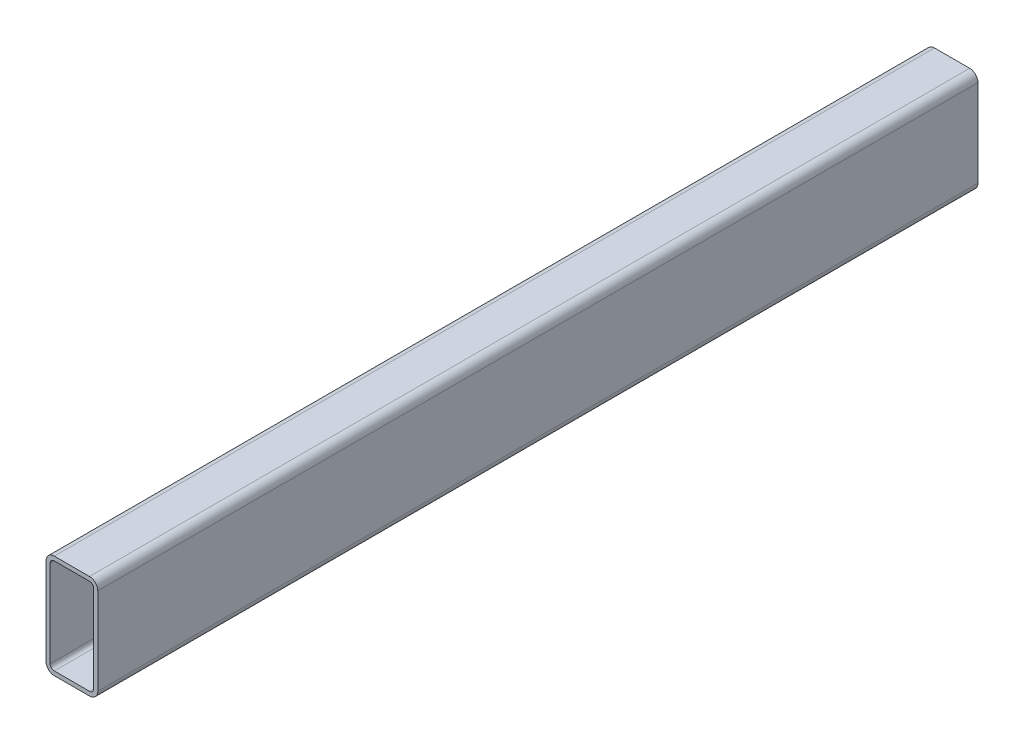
ISO-10303-21;
HEADER;
FILE_DESCRIPTION(('STEP AP214'),'2;1');
FILE_NAME('part.step','',(''),(''),'','','');
FILE_SCHEMA(('AUTOMOTIVE_DESIGN { 1 0 10303 214 1 1 1 1 }'));
ENDSEC;
DATA;
#1=APPLICATION_CONTEXT('core data for automotive mechanical design processes');
#2=APPLICATION_PROTOCOL_DEFINITION('international standard','automotive_design',2000,#1);
#3=PRODUCT_CONTEXT('',#1,'mechanical');
#4=PRODUCT('Part','Part','',(#3));
#5=PRODUCT_RELATED_PRODUCT_CATEGORY('part','',(#4));
#6=PRODUCT_DEFINITION_FORMATION('','',#4);
#7=PRODUCT_DEFINITION_CONTEXT('part definition',#1,'design');
#8=PRODUCT_DEFINITION('design','',#6,#7);
#9=PRODUCT_DEFINITION_SHAPE('','',#8);
#10=(LENGTH_UNIT() NAMED_UNIT(*) SI_UNIT(.MILLI.,.METRE.));
#11=(NAMED_UNIT(*) PLANE_ANGLE_UNIT() SI_UNIT($,.RADIAN.));
#12=(NAMED_UNIT(*) SI_UNIT($,.STERADIAN.) SOLID_ANGLE_UNIT());
#13=UNCERTAINTY_MEASURE_WITH_UNIT(LENGTH_MEASURE(1.E-05),#10,'distance_accuracy_value','');
#14=(GEOMETRIC_REPRESENTATION_CONTEXT(3) GLOBAL_UNCERTAINTY_ASSIGNED_CONTEXT((#13)) GLOBAL_UNIT_ASSIGNED_CONTEXT((#10,
#11,#12)) REPRESENTATION_CONTEXT('',''));
#15=CARTESIAN_POINT('',(0.,0.,0.));
#16=DIRECTION('',(0.,0.,1.));
#17=DIRECTION('',(1.,0.,0.));
#18=AXIS2_PLACEMENT_3D('',#15,#16,#17);
#19=CARTESIAN_POINT('',(42.0000000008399,92.0000000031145,-1186.44303583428));
#20=DIRECTION('',(1.04242850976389E-12,3.86546770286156E-12,-1.));
#21=DIRECTION('',(1.,0.,1.04242850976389E-12));
#22=AXIS2_PLACEMENT_3D('',#19,#20,#21);
#23=PLANE('',#22);
#24=CARTESIAN_POINT('',(42.0000000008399,92.0000000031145,-1186.44303583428));
#25=DIRECTION('',(-1.04242850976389E-12,-3.86546770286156E-12,1.));
#26=DIRECTION('',(1.,0.,1.04242850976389E-12));
#27=AXIS2_PLACEMENT_3D('',#24,#25,#26);
#28=CIRCLE('',#27,8.00000000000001);
#29=CARTESIAN_POINT('',(50.0000000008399,92.0000000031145,-1186.44303583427));
#30=VERTEX_POINT('',#29);
#31=CARTESIAN_POINT('',(42.0000000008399,100.000000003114,-1186.44303583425));
#32=VERTEX_POINT('',#31);
#33=EDGE_CURVE('E232',#30,#32,#28,.T.);
#34=ORIENTED_EDGE('',*,*,#33,.F.);
#35=DIRECTION('',(0.,1.,3.86546770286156E-12));
#36=VECTOR('',#35,1.);
#37=CARTESIAN_POINT('',(50.0000000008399,92.0000000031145,-1186.44303583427));
#38=LINE('',#37,#36);
#39=CARTESIAN_POINT('',(50.0000000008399,8.00000000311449,-1186.44303583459));
#40=VERTEX_POINT('',#39);
#41=EDGE_CURVE('E253',#40,#30,#38,.T.);
#42=ORIENTED_EDGE('',*,*,#41,.F.);
#43=CARTESIAN_POINT('',(42.0000000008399,8.00000000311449,-1186.4430358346));
#44=DIRECTION('',(-1.04242850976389E-12,-3.86546770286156E-12,1.));
#45=DIRECTION('',(1.,0.,1.04242850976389E-12));
#46=AXIS2_PLACEMENT_3D('',#43,#44,#45);
#47=CIRCLE('',#46,8.);
#48=CARTESIAN_POINT('',(42.0000000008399,3.11449397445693E-09,-1186.44303583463));
#49=VERTEX_POINT('',#48);
#50=EDGE_CURVE('E250',#49,#40,#47,.T.);
#51=ORIENTED_EDGE('',*,*,#50,.F.);
#52=DIRECTION('',(1.,0.,1.04242850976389E-12));
#53=VECTOR('',#52,1.);
#54=CARTESIAN_POINT('',(8.00000000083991,3.11449050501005E-09,-1186.44303583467));
#55=LINE('',#54,#53);
#56=CARTESIAN_POINT('',(8.00000000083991,3.11449050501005E-09,-1186.44303583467));
#57=VERTEX_POINT('',#56);
#58=EDGE_CURVE('E247',#57,#49,#55,.T.);
#59=ORIENTED_EDGE('',*,*,#58,.F.);
#60=CARTESIAN_POINT('',(8.00000000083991,8.00000000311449,-1186.44303583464));
#61=DIRECTION('',(-1.04242850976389E-12,-3.86546770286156E-12,1.));
#62=DIRECTION('',(1.,0.,1.04242850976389E-12));
#63=AXIS2_PLACEMENT_3D('',#60,#61,#62);
#64=CIRCLE('',#63,8.);
#65=CARTESIAN_POINT('',(8.39907081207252E-10,8.00000000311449,-1186.44303583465));
#66=VERTEX_POINT('',#65);
#67=EDGE_CURVE('E244',#66,#57,#64,.T.);
#68=ORIENTED_EDGE('',*,*,#67,.F.);
#69=DIRECTION('',(0.,-1.,-3.86546770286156E-12));
#70=VECTOR('',#69,1.);
#71=CARTESIAN_POINT('',(8.39907081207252E-10,8.00000000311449,-1186.44303583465));
#72=LINE('',#71,#70);
#73=CARTESIAN_POINT('',(8.39891261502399E-10,92.0000000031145,-1186.44303583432));
#74=VERTEX_POINT('',#73);
#75=EDGE_CURVE('E241',#74,#66,#72,.T.);
#76=ORIENTED_EDGE('',*,*,#75,.F.);
#77=CARTESIAN_POINT('',(8.00000000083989,92.0000000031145,-1186.44303583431));
#78=DIRECTION('',(-1.04242850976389E-12,-3.86546770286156E-12,1.));
#79=DIRECTION('',(1.,0.,1.04242850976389E-12));
#80=AXIS2_PLACEMENT_3D('',#77,#78,#79);
#81=CIRCLE('',#80,8.);
#82=CARTESIAN_POINT('',(8.00000000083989,100.000000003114,-1186.44303583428));
#83=VERTEX_POINT('',#82);
#84=EDGE_CURVE('E238',#83,#74,#81,.T.);
#85=ORIENTED_EDGE('',*,*,#84,.F.);
#86=DIRECTION('',(-1.,0.,-1.04242850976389E-12));
#87=VECTOR('',#86,1.);
#88=CARTESIAN_POINT('',(42.0000000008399,100.000000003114,-1186.44303583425));
#89=LINE('',#88,#87);
#90=EDGE_CURVE('E235',#32,#83,#89,.T.);
#91=ORIENTED_EDGE('',*,*,#90,.F.);
#92=EDGE_LOOP('',(#34,#42,#51,#59,#68,#76,#85,#91));
#93=FACE_BOUND('',#92,.T.);
#94=DIRECTION('',(0.,-1.,-3.86546770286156E-12));
#95=VECTOR('',#94,1.);
#96=CARTESIAN_POINT('',(4.00000000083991,8.00000000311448,-1186.44303583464));
#97=LINE('',#96,#95);
#98=CARTESIAN_POINT('',(4.00000000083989,92.0000000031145,-1186.44303583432));
#99=VERTEX_POINT('',#98);
#100=CARTESIAN_POINT('',(4.00000000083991,8.00000000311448,-1186.44303583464));
#101=VERTEX_POINT('',#100);
#102=EDGE_CURVE('E146',#99,#101,#97,.T.);
#103=ORIENTED_EDGE('',*,*,#102,.T.);
#104=CARTESIAN_POINT('',(8.00000000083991,8.00000000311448,-1186.44303583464));
#105=DIRECTION('',(-1.04242850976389E-12,-3.86546770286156E-12,1.));
#106=DIRECTION('',(1.,0.,1.04242850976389E-12));
#107=AXIS2_PLACEMENT_3D('',#104,#105,#106);
#108=CIRCLE('',#107,4.);
#109=CARTESIAN_POINT('',(8.00000000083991,4.00000000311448,-1186.44303583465));
#110=VERTEX_POINT('',#109);
#111=EDGE_CURVE('E180',#101,#110,#108,.T.);
#112=ORIENTED_EDGE('',*,*,#111,.T.);
#113=DIRECTION('',(1.,0.,1.04242850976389E-12));
#114=VECTOR('',#113,1.);
#115=CARTESIAN_POINT('',(8.00000000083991,4.00000000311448,-1186.44303583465));
#116=LINE('',#115,#114);
#117=CARTESIAN_POINT('',(42.0000000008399,4.00000000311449,-1186.44303583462));
#118=VERTEX_POINT('',#117);
#119=EDGE_CURVE('E183',#110,#118,#116,.T.);
#120=ORIENTED_EDGE('',*,*,#119,.T.);
#121=CARTESIAN_POINT('',(42.0000000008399,8.00000000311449,-1186.4430358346));
#122=DIRECTION('',(-1.04242850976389E-12,-3.86546770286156E-12,1.));
#123=DIRECTION('',(1.,0.,1.04242850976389E-12));
#124=AXIS2_PLACEMENT_3D('',#121,#122,#123);
#125=CIRCLE('',#124,4.);
#126=CARTESIAN_POINT('',(46.0000000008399,8.00000000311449,-1186.4430358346));
#127=VERTEX_POINT('',#126);
#128=EDGE_CURVE('E186',#118,#127,#125,.T.);
#129=ORIENTED_EDGE('',*,*,#128,.T.);
#130=DIRECTION('',(0.,1.,3.86546770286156E-12));
#131=VECTOR('',#130,1.);
#132=CARTESIAN_POINT('',(46.0000000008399,92.0000000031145,-1186.44303583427));
#133=LINE('',#132,#131);
#134=CARTESIAN_POINT('',(46.0000000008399,92.0000000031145,-1186.44303583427));
#135=VERTEX_POINT('',#134);
#136=EDGE_CURVE('E189',#127,#135,#133,.T.);
#137=ORIENTED_EDGE('',*,*,#136,.T.);
#138=CARTESIAN_POINT('',(42.0000000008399,92.0000000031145,-1186.44303583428));
#139=DIRECTION('',(-1.04242850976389E-12,-3.86546770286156E-12,1.));
#140=DIRECTION('',(1.,0.,1.04242850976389E-12));
#141=AXIS2_PLACEMENT_3D('',#138,#139,#140);
#142=CIRCLE('',#141,4.00000000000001);
#143=CARTESIAN_POINT('',(42.0000000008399,96.0000000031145,-1186.44303583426));
#144=VERTEX_POINT('',#143);
#145=EDGE_CURVE('E192',#135,#144,#142,.T.);
#146=ORIENTED_EDGE('',*,*,#145,.T.);
#147=DIRECTION('',(-1.,0.,-1.04242850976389E-12));
#148=VECTOR('',#147,1.);
#149=CARTESIAN_POINT('',(42.0000000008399,96.0000000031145,-1186.44303583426));
#150=LINE('',#149,#148);
#151=CARTESIAN_POINT('',(8.00000000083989,96.0000000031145,-1186.4430358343));
#152=VERTEX_POINT('',#151);
#153=EDGE_CURVE('E195',#144,#152,#150,.T.);
#154=ORIENTED_EDGE('',*,*,#153,.T.);
#155=CARTESIAN_POINT('',(8.00000000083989,92.0000000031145,-1186.44303583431));
#156=DIRECTION('',(-1.04242850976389E-12,-3.86546770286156E-12,1.));
#157=DIRECTION('',(1.,0.,1.04242850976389E-12));
#158=AXIS2_PLACEMENT_3D('',#155,#156,#157);
#159=CIRCLE('',#158,4.);
#160=EDGE_CURVE('E177',#152,#99,#159,.T.);
#161=ORIENTED_EDGE('',*,*,#160,.T.);
#162=EDGE_LOOP('',(#103,#112,#120,#129,#137,#146,#154,#161));
#163=FACE_BOUND('',#162,.T.);
#164=ADVANCED_FACE('F26',(#93,#163),#23,.T.);
#165=CARTESIAN_POINT('',(41.9999999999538,91.9999999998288,-336.443035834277));
#166=DIRECTION('',(1.04242850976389E-12,3.86546770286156E-12,-1.));
#167=DIRECTION('',(1.,0.,1.04242850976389E-12));
#168=AXIS2_PLACEMENT_3D('',#165,#166,#167);
#169=PLANE('',#168);
#170=CARTESIAN_POINT('',(41.9999999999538,91.9999999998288,-336.443035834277));
#171=DIRECTION('',(-1.04242850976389E-12,-3.86546770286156E-12,1.));
#172=DIRECTION('',(1.,0.,1.04242850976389E-12));
#173=AXIS2_PLACEMENT_3D('',#170,#171,#172);
#174=CIRCLE('',#173,8.00000000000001);
#175=CARTESIAN_POINT('',(49.9999999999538,91.9999999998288,-336.443035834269));
#176=VERTEX_POINT('',#175);
#177=CARTESIAN_POINT('',(41.9999999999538,99.9999999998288,-336.443035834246));
#178=VERTEX_POINT('',#177);
#179=EDGE_CURVE('E148',#176,#178,#174,.T.);
#180=ORIENTED_EDGE('',*,*,#179,.T.);
#181=DIRECTION('',(-1.,0.,-1.04242850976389E-12));
#182=VECTOR('',#181,1.);
#183=CARTESIAN_POINT('',(41.9999999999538,99.9999999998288,-336.443035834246));
#184=LINE('',#183,#182);
#185=CARTESIAN_POINT('',(7.99999999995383,99.9999999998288,-336.443035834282));
#186=VERTEX_POINT('',#185);
#187=EDGE_CURVE('E211',#178,#186,#184,.T.);
#188=ORIENTED_EDGE('',*,*,#187,.T.);
#189=CARTESIAN_POINT('',(7.99999999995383,91.9999999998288,-336.443035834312));
#190=DIRECTION('',(-1.04242850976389E-12,-3.86546770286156E-12,1.));
#191=DIRECTION('',(1.,0.,1.04242850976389E-12));
#192=AXIS2_PLACEMENT_3D('',#189,#190,#191);
#193=CIRCLE('',#192,8.);
#194=CARTESIAN_POINT('',(-4.61729717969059E-11,91.9999999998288,-336.443035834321));
#195=VERTEX_POINT('',#194);
#196=EDGE_CURVE('E214',#186,#195,#193,.T.);
#197=ORIENTED_EDGE('',*,*,#196,.T.);
#198=DIRECTION('',(0.,-1.,-3.86546770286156E-12));
#199=VECTOR('',#198,1.);
#200=CARTESIAN_POINT('',(-4.61571520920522E-11,7.99999999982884,-336.443035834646));
#201=LINE('',#200,#199);
#202=CARTESIAN_POINT('',(-4.61571520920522E-11,7.99999999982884,-336.443035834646));
#203=VERTEX_POINT('',#202);
#204=EDGE_CURVE('E217',#195,#203,#201,.T.);
#205=ORIENTED_EDGE('',*,*,#204,.T.);
#206=CARTESIAN_POINT('',(7.99999999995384,7.99999999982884,-336.443035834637));
#207=DIRECTION('',(-1.04242850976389E-12,-3.86546770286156E-12,1.));
#208=DIRECTION('',(1.,0.,1.04242850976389E-12));
#209=AXIS2_PLACEMENT_3D('',#206,#207,#208);
#210=CIRCLE('',#209,8.);
#211=CARTESIAN_POINT('',(7.99999999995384,-1.7115704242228E-10,-336.443035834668));
#212=VERTEX_POINT('',#211);
#213=EDGE_CURVE('E220',#203,#212,#210,.T.);
#214=ORIENTED_EDGE('',*,*,#213,.T.);
#215=DIRECTION('',(1.,0.,1.04242850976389E-12));
#216=VECTOR('',#215,1.);
#217=CARTESIAN_POINT('',(7.99999999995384,-1.7115704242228E-10,-336.443035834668));
#218=LINE('',#217,#216);
#219=CARTESIAN_POINT('',(41.9999999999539,-1.71153572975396E-10,-336.443035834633));
#220=VERTEX_POINT('',#219);
#221=EDGE_CURVE('E223',#212,#220,#218,.T.);
#222=ORIENTED_EDGE('',*,*,#221,.T.);
#223=CARTESIAN_POINT('',(41.9999999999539,7.99999999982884,-336.443035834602));
#224=DIRECTION('',(-1.04242850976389E-12,-3.86546770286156E-12,1.));
#225=DIRECTION('',(1.,0.,1.04242850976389E-12));
#226=AXIS2_PLACEMENT_3D('',#223,#224,#225);
#227=CIRCLE('',#226,8.);
#228=CARTESIAN_POINT('',(49.9999999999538,7.99999999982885,-336.443035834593));
#229=VERTEX_POINT('',#228);
#230=EDGE_CURVE('E226',#220,#229,#227,.T.);
#231=ORIENTED_EDGE('',*,*,#230,.T.);
#232=DIRECTION('',(0.,1.,3.86546770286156E-12));
#233=VECTOR('',#232,1.);
#234=CARTESIAN_POINT('',(49.9999999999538,91.9999999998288,-336.443035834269));
#235=LINE('',#234,#233);
#236=EDGE_CURVE('E229',#229,#176,#235,.T.);
#237=ORIENTED_EDGE('',*,*,#236,.T.);
#238=EDGE_LOOP('',(#180,#188,#197,#205,#214,#222,#231,#237));
#239=FACE_BOUND('',#238,.T.);
#240=CARTESIAN_POINT('',(7.99999999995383,91.9999999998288,-336.443035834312));
#241=DIRECTION('',(-1.04242850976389E-12,-3.86546770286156E-12,1.));
#242=DIRECTION('',(1.,0.,1.04242850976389E-12));
#243=AXIS2_PLACEMENT_3D('',#240,#241,#242);
#244=CIRCLE('',#243,4.);
#245=CARTESIAN_POINT('',(7.99999999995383,95.9999999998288,-336.443035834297));
#246=VERTEX_POINT('',#245);
#247=CARTESIAN_POINT('',(3.99999999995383,91.9999999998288,-336.443035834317));
#248=VERTEX_POINT('',#247);
#249=EDGE_CURVE('E155',#246,#248,#244,.T.);
#250=ORIENTED_EDGE('',*,*,#249,.F.);
#251=DIRECTION('',(-1.,0.,-1.04242850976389E-12));
#252=VECTOR('',#251,1.);
#253=CARTESIAN_POINT('',(41.9999999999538,95.9999999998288,-336.443035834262));
#254=LINE('',#253,#252);
#255=CARTESIAN_POINT('',(41.9999999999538,95.9999999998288,-336.443035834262));
#256=VERTEX_POINT('',#255);
#257=EDGE_CURVE('E175',#256,#246,#254,.T.);
#258=ORIENTED_EDGE('',*,*,#257,.F.);
#259=CARTESIAN_POINT('',(41.9999999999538,91.9999999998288,-336.443035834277));
#260=DIRECTION('',(-1.04242850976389E-12,-3.86546770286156E-12,1.));
#261=DIRECTION('',(1.,0.,1.04242850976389E-12));
#262=AXIS2_PLACEMENT_3D('',#259,#260,#261);
#263=CIRCLE('',#262,4.00000000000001);
#264=CARTESIAN_POINT('',(45.9999999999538,91.9999999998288,-336.443035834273));
#265=VERTEX_POINT('',#264);
#266=EDGE_CURVE('E173',#265,#256,#263,.T.);
#267=ORIENTED_EDGE('',*,*,#266,.F.);
#268=DIRECTION('',(0.,1.,3.86546770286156E-12));
#269=VECTOR('',#268,1.);
#270=CARTESIAN_POINT('',(45.9999999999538,91.9999999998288,-336.443035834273));
#271=LINE('',#270,#269);
#272=CARTESIAN_POINT('',(45.9999999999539,7.99999999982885,-336.443035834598));
#273=VERTEX_POINT('',#272);
#274=EDGE_CURVE('E170',#273,#265,#271,.T.);
#275=ORIENTED_EDGE('',*,*,#274,.F.);
#276=CARTESIAN_POINT('',(41.9999999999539,7.99999999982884,-336.443035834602));
#277=DIRECTION('',(-1.04242850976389E-12,-3.86546770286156E-12,1.));
#278=DIRECTION('',(1.,0.,1.04242850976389E-12));
#279=AXIS2_PLACEMENT_3D('',#276,#277,#278);
#280=CIRCLE('',#279,4.);
#281=CARTESIAN_POINT('',(41.9999999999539,3.99999999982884,-336.443035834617));
#282=VERTEX_POINT('',#281);
#283=EDGE_CURVE('E167',#282,#273,#280,.T.);
#284=ORIENTED_EDGE('',*,*,#283,.F.);
#285=DIRECTION('',(1.,0.,1.04242850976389E-12));
#286=VECTOR('',#285,1.);
#287=CARTESIAN_POINT('',(7.99999999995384,3.99999999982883,-336.443035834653));
#288=LINE('',#287,#286);
#289=CARTESIAN_POINT('',(7.99999999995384,3.99999999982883,-336.443035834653));
#290=VERTEX_POINT('',#289);
#291=EDGE_CURVE('E164',#290,#282,#288,.T.);
#292=ORIENTED_EDGE('',*,*,#291,.F.);
#293=CARTESIAN_POINT('',(7.99999999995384,7.99999999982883,-336.443035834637));
#294=DIRECTION('',(-1.04242850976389E-12,-3.86546770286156E-12,1.));
#295=DIRECTION('',(1.,0.,1.04242850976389E-12));
#296=AXIS2_PLACEMENT_3D('',#293,#294,#295);
#297=CIRCLE('',#296,4.);
#298=CARTESIAN_POINT('',(3.99999999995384,7.99999999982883,-336.443035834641));
#299=VERTEX_POINT('',#298);
#300=EDGE_CURVE('E158',#299,#290,#297,.T.);
#301=ORIENTED_EDGE('',*,*,#300,.F.);
#302=DIRECTION('',(0.,-1.,-3.86546770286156E-12));
#303=VECTOR('',#302,1.);
#304=CARTESIAN_POINT('',(3.99999999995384,7.99999999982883,-336.443035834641));
#305=LINE('',#304,#303);
#306=EDGE_CURVE('E143',#248,#299,#305,.T.);
#307=ORIENTED_EDGE('',*,*,#306,.F.);
#308=EDGE_LOOP('',(#250,#258,#267,#275,#284,#292,#301,#307));
#309=FACE_BOUND('',#308,.T.);
#310=ADVANCED_FACE('F153',(#239,#309),#169,.F.);
#311=CARTESIAN_POINT('',(42.0000000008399,92.0000000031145,-1186.44303583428));
#312=DIRECTION('',(-1.04242850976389E-12,-3.86546770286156E-12,1.));
#313=DIRECTION('',(-1.,0.,-1.04242850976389E-12));
#314=AXIS2_PLACEMENT_3D('',#311,#312,#313);
#315=CYLINDRICAL_SURFACE('',#314,8.00000000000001);
#316=ORIENTED_EDGE('',*,*,#179,.F.);
#317=DIRECTION('',(-1.04242850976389E-12,-3.86546770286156E-12,1.));
#318=VECTOR('',#317,1.);
#319=CARTESIAN_POINT('',(50.0000000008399,92.0000000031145,-1186.44303583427));
#320=LINE('',#319,#318);
#321=EDGE_CURVE('E256',#30,#176,#320,.T.);
#322=ORIENTED_EDGE('',*,*,#321,.F.);
#323=ORIENTED_EDGE('',*,*,#33,.T.);
#324=DIRECTION('',(-1.04242850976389E-12,-3.86546770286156E-12,1.));
#325=VECTOR('',#324,1.);
#326=CARTESIAN_POINT('',(42.0000000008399,100.000000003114,-1186.44303583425));
#327=LINE('',#326,#325);
#328=EDGE_CURVE('E11',#32,#178,#327,.T.);
#329=ORIENTED_EDGE('',*,*,#328,.T.);
#330=EDGE_LOOP('',(#316,#322,#323,#329));
#331=FACE_BOUND('',#330,.T.);
#332=ADVANCED_FACE('F28',(#331),#315,.T.);
#333=CARTESIAN_POINT('',(42.0000000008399,100.000000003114,-1186.44303583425));
#334=DIRECTION('',(0.,-1.,-3.86546770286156E-12));
#335=DIRECTION('',(-1.04242850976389E-12,-3.86546770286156E-12,1.));
#336=AXIS2_PLACEMENT_3D('',#333,#334,#335);
#337=PLANE('',#336);
#338=ORIENTED_EDGE('',*,*,#187,.F.);
#339=ORIENTED_EDGE('',*,*,#328,.F.);
#340=ORIENTED_EDGE('',*,*,#90,.T.);
#341=DIRECTION('',(-1.04242850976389E-12,-3.86546770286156E-12,1.));
#342=VECTOR('',#341,1.);
#343=CARTESIAN_POINT('',(8.00000000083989,100.000000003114,-1186.44303583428));
#344=LINE('',#343,#342);
#345=EDGE_CURVE('E34',#83,#186,#344,.T.);
#346=ORIENTED_EDGE('',*,*,#345,.T.);
#347=EDGE_LOOP('',(#338,#339,#340,#346));
#348=FACE_BOUND('',#347,.T.);
#349=ADVANCED_FACE('F270',(#348),#337,.F.);
#350=CARTESIAN_POINT('',(8.00000000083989,92.0000000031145,-1186.44303583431));
#351=DIRECTION('',(-1.04242850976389E-12,-3.86546770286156E-12,1.));
#352=DIRECTION('',(-1.,0.,-1.04242850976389E-12));
#353=AXIS2_PLACEMENT_3D('',#350,#351,#352);
#354=CYLINDRICAL_SURFACE('',#353,8.);
#355=ORIENTED_EDGE('',*,*,#196,.F.);
#356=ORIENTED_EDGE('',*,*,#345,.F.);
#357=ORIENTED_EDGE('',*,*,#84,.T.);
#358=DIRECTION('',(-1.04242850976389E-12,-3.86546770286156E-12,1.));
#359=VECTOR('',#358,1.);
#360=CARTESIAN_POINT('',(8.39891261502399E-10,92.0000000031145,-1186.44303583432));
#361=LINE('',#360,#359);
#362=EDGE_CURVE('E266',#74,#195,#361,.T.);
#363=ORIENTED_EDGE('',*,*,#362,.T.);
#364=EDGE_LOOP('',(#355,#356,#357,#363));
#365=FACE_BOUND('',#364,.T.);
#366=ADVANCED_FACE('F274',(#365),#354,.T.);
#367=CARTESIAN_POINT('',(8.39907081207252E-10,8.00000000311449,-1186.44303583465));
#368=DIRECTION('',(1.,0.,1.04242850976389E-12));
#369=DIRECTION('',(0.,1.,3.86546770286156E-12));
#370=AXIS2_PLACEMENT_3D('',#367,#368,#369);
#371=PLANE('',#370);
#372=ORIENTED_EDGE('',*,*,#204,.F.);
#373=ORIENTED_EDGE('',*,*,#362,.F.);
#374=ORIENTED_EDGE('',*,*,#75,.T.);
#375=DIRECTION('',(-1.04242850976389E-12,-3.86546770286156E-12,1.));
#376=VECTOR('',#375,1.);
#377=CARTESIAN_POINT('',(8.39907081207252E-10,8.00000000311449,-1186.44303583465));
#378=LINE('',#377,#376);
#379=EDGE_CURVE('E264',#66,#203,#378,.T.);
#380=ORIENTED_EDGE('',*,*,#379,.T.);
#381=EDGE_LOOP('',(#372,#373,#374,#380));
#382=FACE_BOUND('',#381,.T.);
#383=ADVANCED_FACE('F288',(#382),#371,.F.);
#384=CARTESIAN_POINT('',(8.00000000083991,8.00000000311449,-1186.44303583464));
#385=DIRECTION('',(-1.04242850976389E-12,-3.86546770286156E-12,1.));
#386=DIRECTION('',(-1.,0.,-1.04242850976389E-12));
#387=AXIS2_PLACEMENT_3D('',#384,#385,#386);
#388=CYLINDRICAL_SURFACE('',#387,8.);
#389=ORIENTED_EDGE('',*,*,#213,.F.);
#390=ORIENTED_EDGE('',*,*,#379,.F.);
#391=ORIENTED_EDGE('',*,*,#67,.T.);
#392=DIRECTION('',(-1.04242850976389E-12,-3.86546770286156E-12,1.));
#393=VECTOR('',#392,1.);
#394=CARTESIAN_POINT('',(8.00000000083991,3.11449050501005E-09,-1186.44303583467));
#395=LINE('',#394,#393);
#396=EDGE_CURVE('E262',#57,#212,#395,.T.);
#397=ORIENTED_EDGE('',*,*,#396,.T.);
#398=EDGE_LOOP('',(#389,#390,#391,#397));
#399=FACE_BOUND('',#398,.T.);
#400=ADVANCED_FACE('F292',(#399),#388,.T.);
#401=CARTESIAN_POINT('',(8.00000000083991,3.11449050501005E-09,-1186.44303583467));
#402=DIRECTION('',(0.,1.,3.86546770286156E-12));
#403=DIRECTION('',(-1.,0.,-1.04242850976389E-12));
#404=AXIS2_PLACEMENT_3D('',#401,#402,#403);
#405=PLANE('',#404);
#406=ORIENTED_EDGE('',*,*,#221,.F.);
#407=ORIENTED_EDGE('',*,*,#396,.F.);
#408=ORIENTED_EDGE('',*,*,#58,.T.);
#409=DIRECTION('',(-1.04242850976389E-12,-3.86546770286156E-12,1.));
#410=VECTOR('',#409,1.);
#411=CARTESIAN_POINT('',(42.0000000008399,3.11449397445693E-09,-1186.44303583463));
#412=LINE('',#411,#410);
#413=EDGE_CURVE('E260',#49,#220,#412,.T.);
#414=ORIENTED_EDGE('',*,*,#413,.T.);
#415=EDGE_LOOP('',(#406,#407,#408,#414));
#416=FACE_BOUND('',#415,.T.);
#417=ADVANCED_FACE('F294',(#416),#405,.F.);
#418=CARTESIAN_POINT('',(42.0000000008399,8.00000000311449,-1186.4430358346));
#419=DIRECTION('',(-1.04242850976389E-12,-3.86546770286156E-12,1.));
#420=DIRECTION('',(-1.,0.,-1.04242850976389E-12));
#421=AXIS2_PLACEMENT_3D('',#418,#419,#420);
#422=CYLINDRICAL_SURFACE('',#421,8.);
#423=ORIENTED_EDGE('',*,*,#230,.F.);
#424=ORIENTED_EDGE('',*,*,#413,.F.);
#425=ORIENTED_EDGE('',*,*,#50,.T.);
#426=DIRECTION('',(-1.04242850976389E-12,-3.86546770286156E-12,1.));
#427=VECTOR('',#426,1.);
#428=CARTESIAN_POINT('',(50.0000000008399,8.00000000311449,-1186.44303583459));
#429=LINE('',#428,#427);
#430=EDGE_CURVE('E258',#40,#229,#429,.T.);
#431=ORIENTED_EDGE('',*,*,#430,.T.);
#432=EDGE_LOOP('',(#423,#424,#425,#431));
#433=FACE_BOUND('',#432,.T.);
#434=ADVANCED_FACE('F298',(#433),#422,.T.);
#435=CARTESIAN_POINT('',(50.0000000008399,92.0000000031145,-1186.44303583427));
#436=DIRECTION('',(-1.,0.,-1.04242850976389E-12));
#437=DIRECTION('',(0.,-1.,-3.86546770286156E-12));
#438=AXIS2_PLACEMENT_3D('',#435,#436,#437);
#439=PLANE('',#438);
#440=ORIENTED_EDGE('',*,*,#236,.F.);
#441=ORIENTED_EDGE('',*,*,#430,.F.);
#442=ORIENTED_EDGE('',*,*,#41,.T.);
#443=ORIENTED_EDGE('',*,*,#321,.T.);
#444=EDGE_LOOP('',(#440,#441,#442,#443));
#445=FACE_BOUND('',#444,.T.);
#446=ADVANCED_FACE('F300',(#445),#439,.F.);
#447=CARTESIAN_POINT('',(8.00000000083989,92.0000000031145,-1186.44303583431));
#448=DIRECTION('',(-1.04242850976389E-12,-3.86546770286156E-12,1.));
#449=DIRECTION('',(-1.,0.,-1.04242850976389E-12));
#450=AXIS2_PLACEMENT_3D('',#447,#448,#449);
#451=CYLINDRICAL_SURFACE('',#450,4.);
#452=ORIENTED_EDGE('',*,*,#249,.T.);
#453=DIRECTION('',(-1.04242850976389E-12,-3.86546770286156E-12,1.));
#454=VECTOR('',#453,1.);
#455=CARTESIAN_POINT('',(4.00000000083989,92.0000000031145,-1186.44303583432));
#456=LINE('',#455,#454);
#457=EDGE_CURVE('E140',#99,#248,#456,.T.);
#458=ORIENTED_EDGE('',*,*,#457,.F.);
#459=ORIENTED_EDGE('',*,*,#160,.F.);
#460=DIRECTION('',(-1.04242850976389E-12,-3.86546770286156E-12,1.));
#461=VECTOR('',#460,1.);
#462=CARTESIAN_POINT('',(8.00000000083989,96.0000000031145,-1186.4430358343));
#463=LINE('',#462,#461);
#464=EDGE_CURVE('E49',#152,#246,#463,.T.);
#465=ORIENTED_EDGE('',*,*,#464,.T.);
#466=EDGE_LOOP('',(#452,#458,#459,#465));
#467=FACE_BOUND('',#466,.T.);
#468=ADVANCED_FACE('F160',(#467),#451,.F.);
#469=CARTESIAN_POINT('',(4.00000000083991,8.00000000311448,-1186.44303583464));
#470=DIRECTION('',(1.,0.,1.04242850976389E-12));
#471=DIRECTION('',(0.,1.,3.86546770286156E-12));
#472=AXIS2_PLACEMENT_3D('',#469,#470,#471);
#473=PLANE('',#472);
#474=ORIENTED_EDGE('',*,*,#306,.T.);
#475=DIRECTION('',(-1.04242850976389E-12,-3.86546770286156E-12,1.));
#476=VECTOR('',#475,1.);
#477=CARTESIAN_POINT('',(4.00000000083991,8.00000000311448,-1186.44303583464));
#478=LINE('',#477,#476);
#479=EDGE_CURVE('E149',#101,#299,#478,.T.);
#480=ORIENTED_EDGE('',*,*,#479,.F.);
#481=ORIENTED_EDGE('',*,*,#102,.F.);
#482=ORIENTED_EDGE('',*,*,#457,.T.);
#483=EDGE_LOOP('',(#474,#480,#481,#482));
#484=FACE_BOUND('',#483,.T.);
#485=ADVANCED_FACE('F142',(#484),#473,.T.);
#486=CARTESIAN_POINT('',(8.00000000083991,8.00000000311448,-1186.44303583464));
#487=DIRECTION('',(-1.04242850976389E-12,-3.86546770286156E-12,1.));
#488=DIRECTION('',(-1.,0.,-1.04242850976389E-12));
#489=AXIS2_PLACEMENT_3D('',#486,#487,#488);
#490=CYLINDRICAL_SURFACE('',#489,4.);
#491=ORIENTED_EDGE('',*,*,#300,.T.);
#492=DIRECTION('',(-1.04242850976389E-12,-3.86546770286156E-12,1.));
#493=VECTOR('',#492,1.);
#494=CARTESIAN_POINT('',(8.00000000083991,4.00000000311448,-1186.44303583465));
#495=LINE('',#494,#493);
#496=EDGE_CURVE('E206',#110,#290,#495,.T.);
#497=ORIENTED_EDGE('',*,*,#496,.F.);
#498=ORIENTED_EDGE('',*,*,#111,.F.);
#499=ORIENTED_EDGE('',*,*,#479,.T.);
#500=EDGE_LOOP('',(#491,#497,#498,#499));
#501=FACE_BOUND('',#500,.T.);
#502=ADVANCED_FACE('F318',(#501),#490,.F.);
#503=CARTESIAN_POINT('',(8.00000000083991,4.00000000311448,-1186.44303583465));
#504=DIRECTION('',(0.,1.,3.86546770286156E-12));
#505=DIRECTION('',(-1.,0.,-1.04242850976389E-12));
#506=AXIS2_PLACEMENT_3D('',#503,#504,#505);
#507=PLANE('',#506);
#508=ORIENTED_EDGE('',*,*,#291,.T.);
#509=DIRECTION('',(-1.04242850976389E-12,-3.86546770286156E-12,1.));
#510=VECTOR('',#509,1.);
#511=CARTESIAN_POINT('',(42.0000000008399,4.00000000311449,-1186.44303583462));
#512=LINE('',#511,#510);
#513=EDGE_CURVE('E204',#118,#282,#512,.T.);
#514=ORIENTED_EDGE('',*,*,#513,.F.);
#515=ORIENTED_EDGE('',*,*,#119,.F.);
#516=ORIENTED_EDGE('',*,*,#496,.T.);
#517=EDGE_LOOP('',(#508,#514,#515,#516));
#518=FACE_BOUND('',#517,.T.);
#519=ADVANCED_FACE('F321',(#518),#507,.T.);
#520=CARTESIAN_POINT('',(42.0000000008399,8.00000000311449,-1186.4430358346));
#521=DIRECTION('',(-1.04242850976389E-12,-3.86546770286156E-12,1.));
#522=DIRECTION('',(-1.,0.,-1.04242850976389E-12));
#523=AXIS2_PLACEMENT_3D('',#520,#521,#522);
#524=CYLINDRICAL_SURFACE('',#523,4.);
#525=ORIENTED_EDGE('',*,*,#283,.T.);
#526=DIRECTION('',(-1.04242850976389E-12,-3.86546770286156E-12,1.));
#527=VECTOR('',#526,1.);
#528=CARTESIAN_POINT('',(46.0000000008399,8.00000000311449,-1186.4430358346));
#529=LINE('',#528,#527);
#530=EDGE_CURVE('E202',#127,#273,#529,.T.);
#531=ORIENTED_EDGE('',*,*,#530,.F.);
#532=ORIENTED_EDGE('',*,*,#128,.F.);
#533=ORIENTED_EDGE('',*,*,#513,.T.);
#534=EDGE_LOOP('',(#525,#531,#532,#533));
#535=FACE_BOUND('',#534,.T.);
#536=ADVANCED_FACE('F325',(#535),#524,.F.);
#537=CARTESIAN_POINT('',(46.0000000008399,92.0000000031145,-1186.44303583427));
#538=DIRECTION('',(-1.,0.,-1.04242850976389E-12));
#539=DIRECTION('',(0.,-1.,-3.86546770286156E-12));
#540=AXIS2_PLACEMENT_3D('',#537,#538,#539);
#541=PLANE('',#540);
#542=ORIENTED_EDGE('',*,*,#274,.T.);
#543=DIRECTION('',(-1.04242850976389E-12,-3.86546770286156E-12,1.));
#544=VECTOR('',#543,1.);
#545=CARTESIAN_POINT('',(46.0000000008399,92.0000000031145,-1186.44303583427));
#546=LINE('',#545,#544);
#547=EDGE_CURVE('E200',#135,#265,#546,.T.);
#548=ORIENTED_EDGE('',*,*,#547,.F.);
#549=ORIENTED_EDGE('',*,*,#136,.F.);
#550=ORIENTED_EDGE('',*,*,#530,.T.);
#551=EDGE_LOOP('',(#542,#548,#549,#550));
#552=FACE_BOUND('',#551,.T.);
#553=ADVANCED_FACE('F329',(#552),#541,.T.);
#554=CARTESIAN_POINT('',(42.0000000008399,92.0000000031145,-1186.44303583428));
#555=DIRECTION('',(-1.04242850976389E-12,-3.86546770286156E-12,1.));
#556=DIRECTION('',(-1.,0.,-1.04242850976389E-12));
#557=AXIS2_PLACEMENT_3D('',#554,#555,#556);
#558=CYLINDRICAL_SURFACE('',#557,4.00000000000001);
#559=ORIENTED_EDGE('',*,*,#266,.T.);
#560=DIRECTION('',(-1.04242850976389E-12,-3.86546770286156E-12,1.));
#561=VECTOR('',#560,1.);
#562=CARTESIAN_POINT('',(42.0000000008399,96.0000000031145,-1186.44303583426));
#563=LINE('',#562,#561);
#564=EDGE_CURVE('E41',#144,#256,#563,.T.);
#565=ORIENTED_EDGE('',*,*,#564,.F.);
#566=ORIENTED_EDGE('',*,*,#145,.F.);
#567=ORIENTED_EDGE('',*,*,#547,.T.);
#568=EDGE_LOOP('',(#559,#565,#566,#567));
#569=FACE_BOUND('',#568,.T.);
#570=ADVANCED_FACE('F333',(#569),#558,.F.);
#571=CARTESIAN_POINT('',(42.0000000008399,96.0000000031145,-1186.44303583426));
#572=DIRECTION('',(0.,-1.,-3.86546770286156E-12));
#573=DIRECTION('',(-1.04242850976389E-12,-3.86546770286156E-12,1.));
#574=AXIS2_PLACEMENT_3D('',#571,#572,#573);
#575=PLANE('',#574);
#576=ORIENTED_EDGE('',*,*,#257,.T.);
#577=ORIENTED_EDGE('',*,*,#464,.F.);
#578=ORIENTED_EDGE('',*,*,#153,.F.);
#579=ORIENTED_EDGE('',*,*,#564,.T.);
#580=EDGE_LOOP('',(#576,#577,#578,#579));
#581=FACE_BOUND('',#580,.T.);
#582=ADVANCED_FACE('F337',(#581),#575,.T.);
#583=CLOSED_SHELL('',(#164,#310,#332,#349,#366,#383,#400,#417,#434,#446,#468,#485,#502,#519,
#536,#553,#570,#582));
#584=MANIFOLD_SOLID_BREP('B2',#583);
#585=ADVANCED_BREP_SHAPE_REPRESENTATION('',(#18,#584),#14);
#586=SHAPE_DEFINITION_REPRESENTATION(#9,#585);
ENDSEC;
END-ISO-10303-21;
